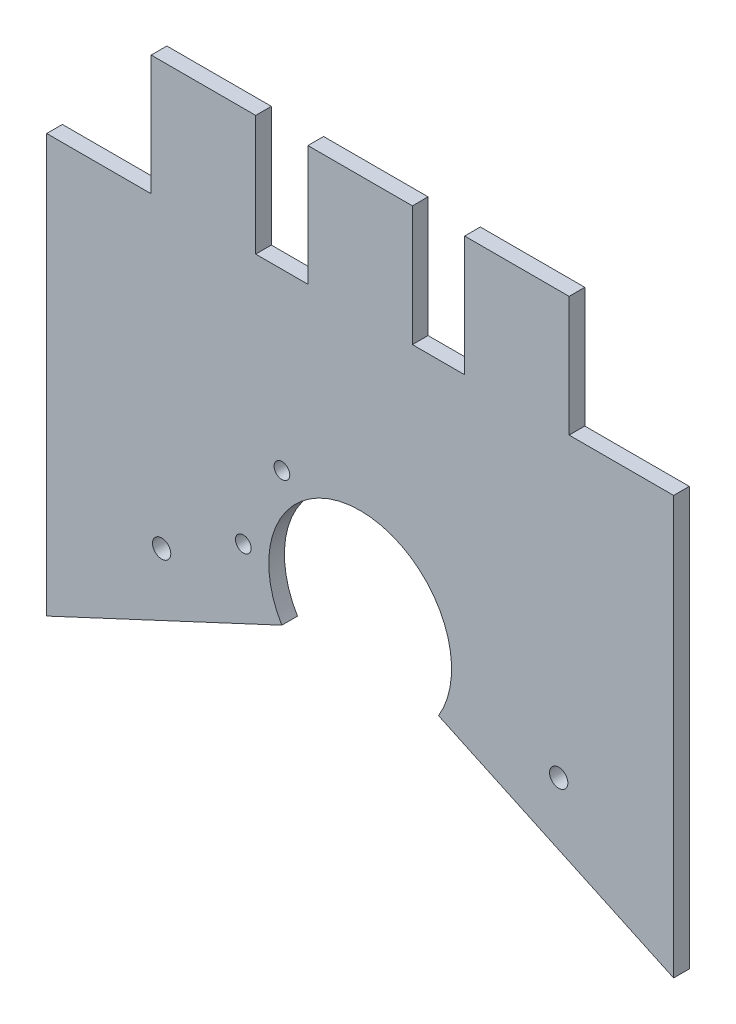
ISO-10303-21;
HEADER;
FILE_DESCRIPTION(('STEP AP214'),'2;1');
FILE_NAME('part.step','',(''),(''),'','','');
FILE_SCHEMA(('AUTOMOTIVE_DESIGN { 1 0 10303 214 1 1 1 1 }'));
ENDSEC;
DATA;
#1=APPLICATION_CONTEXT('core data for automotive mechanical design processes');
#2=APPLICATION_PROTOCOL_DEFINITION('international standard','automotive_design',2000,#1);
#3=PRODUCT_CONTEXT('',#1,'mechanical');
#4=PRODUCT('Part','Part','',(#3));
#5=PRODUCT_RELATED_PRODUCT_CATEGORY('part','',(#4));
#6=PRODUCT_DEFINITION_FORMATION('','',#4);
#7=PRODUCT_DEFINITION_CONTEXT('part definition',#1,'design');
#8=PRODUCT_DEFINITION('design','',#6,#7);
#9=PRODUCT_DEFINITION_SHAPE('','',#8);
#10=(LENGTH_UNIT() NAMED_UNIT(*) SI_UNIT(.MILLI.,.METRE.));
#11=(NAMED_UNIT(*) PLANE_ANGLE_UNIT() SI_UNIT($,.RADIAN.));
#12=(NAMED_UNIT(*) SI_UNIT($,.STERADIAN.) SOLID_ANGLE_UNIT());
#13=UNCERTAINTY_MEASURE_WITH_UNIT(LENGTH_MEASURE(1.E-05),#10,'distance_accuracy_value','');
#14=(GEOMETRIC_REPRESENTATION_CONTEXT(3) GLOBAL_UNCERTAINTY_ASSIGNED_CONTEXT((#13)) GLOBAL_UNIT_ASSIGNED_CONTEXT((#10,
#11,#12)) REPRESENTATION_CONTEXT('',''));
#15=CARTESIAN_POINT('',(0.,0.,0.));
#16=DIRECTION('',(0.,0.,1.));
#17=DIRECTION('',(1.,0.,0.));
#18=AXIS2_PLACEMENT_3D('',#15,#16,#17);
#19=CARTESIAN_POINT('',(0.,-73.,3.));
#20=DIRECTION('',(0.,0.,-1.));
#21=DIRECTION('',(-1.,0.,0.));
#22=AXIS2_PLACEMENT_3D('',#19,#20,#21);
#23=CYLINDRICAL_SURFACE('',#22,17.5);
#24=CARTESIAN_POINT('',(0.,-73.,0.));
#25=DIRECTION('',(0.,0.,1.));
#26=DIRECTION('',(1.,0.,0.));
#27=AXIS2_PLACEMENT_3D('',#24,#25,#26);
#28=CIRCLE('',#27,17.5);
#29=CARTESIAN_POINT('',(14.9989309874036,-82.0156568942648,0.));
#30=VERTEX_POINT('',#29);
#31=CARTESIAN_POINT('',(-14.9989309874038,-82.0156568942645,0.));
#32=VERTEX_POINT('',#31);
#33=EDGE_CURVE('E201',#30,#32,#28,.T.);
#34=ORIENTED_EDGE('',*,*,#33,.F.);
#35=DIRECTION('',(0.,0.,-1.));
#36=VECTOR('',#35,1.);
#37=CARTESIAN_POINT('',(14.9989309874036,-82.0156568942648,3.));
#38=LINE('',#37,#36);
#39=CARTESIAN_POINT('',(14.9989309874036,-82.0156568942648,3.));
#40=VERTEX_POINT('',#39);
#41=EDGE_CURVE('E11',#40,#30,#38,.T.);
#42=ORIENTED_EDGE('',*,*,#41,.F.);
#43=CARTESIAN_POINT('',(0.,-73.,3.));
#44=DIRECTION('',(0.,0.,1.));
#45=DIRECTION('',(1.,0.,0.));
#46=AXIS2_PLACEMENT_3D('',#43,#44,#45);
#47=CIRCLE('',#46,17.5);
#48=CARTESIAN_POINT('',(-14.9989309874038,-82.0156568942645,3.));
#49=VERTEX_POINT('',#48);
#50=EDGE_CURVE('E256',#40,#49,#47,.T.);
#51=ORIENTED_EDGE('',*,*,#50,.T.);
#52=DIRECTION('',(0.,0.,-1.));
#53=VECTOR('',#52,1.);
#54=CARTESIAN_POINT('',(-14.9989309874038,-82.0156568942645,3.));
#55=LINE('',#54,#53);
#56=EDGE_CURVE('E116',#49,#32,#55,.T.);
#57=ORIENTED_EDGE('',*,*,#56,.T.);
#58=EDGE_LOOP('',(#34,#42,#51,#57));
#59=FACE_BOUND('',#58,.T.);
#60=ADVANCED_FACE('F35',(#59),#23,.F.);
#61=CARTESIAN_POINT('',(-28.7349171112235,-61.6222286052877,3.));
#62=DIRECTION('',(0.422618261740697,0.906307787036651,0.));
#63=DIRECTION('',(-0.906307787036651,0.422618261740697,0.));
#64=AXIS2_PLACEMENT_3D('',#61,#62,#63);
#65=PLANE('',#64);
#66=DIRECTION('',(0.906307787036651,-0.422618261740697,0.));
#67=VECTOR('',#66,1.);
#68=CARTESIAN_POINT('',(-28.7349171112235,-61.6222286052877,0.));
#69=LINE('',#68,#67);
#70=CARTESIAN_POINT('',(60.,-103.,0.));
#71=VERTEX_POINT('',#70);
#72=EDGE_CURVE('E204',#30,#71,#69,.T.);
#73=ORIENTED_EDGE('',*,*,#72,.T.);
#74=DIRECTION('',(0.,0.,-1.));
#75=VECTOR('',#74,1.);
#76=CARTESIAN_POINT('',(60.,-103.,3.));
#77=LINE('',#76,#75);
#78=CARTESIAN_POINT('',(60.,-103.,3.));
#79=VERTEX_POINT('',#78);
#80=EDGE_CURVE('E43',#79,#71,#77,.T.);
#81=ORIENTED_EDGE('',*,*,#80,.F.);
#82=DIRECTION('',(0.906307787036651,-0.422618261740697,0.));
#83=VECTOR('',#82,1.);
#84=CARTESIAN_POINT('',(-28.7349171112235,-61.6222286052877,3.));
#85=LINE('',#84,#83);
#86=EDGE_CURVE('E313',#40,#79,#85,.T.);
#87=ORIENTED_EDGE('',*,*,#86,.F.);
#88=ORIENTED_EDGE('',*,*,#41,.T.);
#89=EDGE_LOOP('',(#73,#81,#87,#88));
#90=FACE_BOUND('',#89,.T.);
#91=ADVANCED_FACE('F352',(#90),#65,.F.);
#92=CARTESIAN_POINT('',(59.9999999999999,0.,3.));
#93=DIRECTION('',(-1.,0.,0.));
#94=DIRECTION('',(0.,-1.,0.));
#95=AXIS2_PLACEMENT_3D('',#92,#93,#94);
#96=PLANE('',#95);
#97=DIRECTION('',(0.,1.,0.));
#98=VECTOR('',#97,1.);
#99=CARTESIAN_POINT('',(59.9999999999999,0.,0.));
#100=LINE('',#99,#98);
#101=CARTESIAN_POINT('',(60.,-23.,0.));
#102=VERTEX_POINT('',#101);
#103=EDGE_CURVE('E206',#71,#102,#100,.T.);
#104=ORIENTED_EDGE('',*,*,#103,.T.);
#105=DIRECTION('',(0.,0.,-1.));
#106=VECTOR('',#105,1.);
#107=CARTESIAN_POINT('',(60.,-23.,3.));
#108=LINE('',#107,#106);
#109=CARTESIAN_POINT('',(60.,-23.,3.));
#110=VERTEX_POINT('',#109);
#111=EDGE_CURVE('E286',#110,#102,#108,.T.);
#112=ORIENTED_EDGE('',*,*,#111,.F.);
#113=DIRECTION('',(0.,1.,0.));
#114=VECTOR('',#113,1.);
#115=CARTESIAN_POINT('',(59.9999999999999,0.,3.));
#116=LINE('',#115,#114);
#117=EDGE_CURVE('E294',#79,#110,#116,.T.);
#118=ORIENTED_EDGE('',*,*,#117,.F.);
#119=ORIENTED_EDGE('',*,*,#80,.T.);
#120=EDGE_LOOP('',(#104,#112,#118,#119));
#121=FACE_BOUND('',#120,.T.);
#122=ADVANCED_FACE('F292',(#121),#96,.F.);
#123=CARTESIAN_POINT('',(0.,-23.,3.));
#124=DIRECTION('',(0.,1.,0.));
#125=DIRECTION('',(0.,0.,1.));
#126=AXIS2_PLACEMENT_3D('',#123,#124,#125);
#127=PLANE('',#126);
#128=DIRECTION('',(1.,0.,0.));
#129=VECTOR('',#128,1.);
#130=CARTESIAN_POINT('',(0.,-23.,0.));
#131=LINE('',#130,#129);
#132=CARTESIAN_POINT('',(40.,-23.,0.));
#133=VERTEX_POINT('',#132);
#134=EDGE_CURVE('E209',#133,#102,#131,.T.);
#135=ORIENTED_EDGE('',*,*,#134,.F.);
#136=DIRECTION('',(0.,0.,-1.));
#137=VECTOR('',#136,1.);
#138=CARTESIAN_POINT('',(40.,-23.,3.));
#139=LINE('',#138,#137);
#140=CARTESIAN_POINT('',(40.,-23.,3.));
#141=VERTEX_POINT('',#140);
#142=EDGE_CURVE('E284',#141,#133,#139,.T.);
#143=ORIENTED_EDGE('',*,*,#142,.F.);
#144=DIRECTION('',(1.,0.,0.));
#145=VECTOR('',#144,1.);
#146=CARTESIAN_POINT('',(0.,-23.,3.));
#147=LINE('',#146,#145);
#148=EDGE_CURVE('E306',#141,#110,#147,.T.);
#149=ORIENTED_EDGE('',*,*,#148,.T.);
#150=ORIENTED_EDGE('',*,*,#111,.T.);
#151=EDGE_LOOP('',(#135,#143,#149,#150));
#152=FACE_BOUND('',#151,.T.);
#153=ADVANCED_FACE('F303',(#152),#127,.T.);
#154=CARTESIAN_POINT('',(40.,0.,3.));
#155=DIRECTION('',(1.,0.,0.));
#156=DIRECTION('',(0.,0.,-1.));
#157=AXIS2_PLACEMENT_3D('',#154,#155,#156);
#158=PLANE('',#157);
#159=DIRECTION('',(0.,-1.,0.));
#160=VECTOR('',#159,1.);
#161=CARTESIAN_POINT('',(40.,0.,0.));
#162=LINE('',#161,#160);
#163=CARTESIAN_POINT('',(40.,0.,0.));
#164=VERTEX_POINT('',#163);
#165=EDGE_CURVE('E212',#164,#133,#162,.T.);
#166=ORIENTED_EDGE('',*,*,#165,.F.);
#167=DIRECTION('',(0.,0.,-1.));
#168=VECTOR('',#167,1.);
#169=CARTESIAN_POINT('',(40.,0.,3.));
#170=LINE('',#169,#168);
#171=CARTESIAN_POINT('',(40.,0.,3.));
#172=VERTEX_POINT('',#171);
#173=EDGE_CURVE('E282',#172,#164,#170,.T.);
#174=ORIENTED_EDGE('',*,*,#173,.F.);
#175=DIRECTION('',(0.,-1.,0.));
#176=VECTOR('',#175,1.);
#177=CARTESIAN_POINT('',(40.,0.,3.));
#178=LINE('',#177,#176);
#179=EDGE_CURVE('E309',#172,#141,#178,.T.);
#180=ORIENTED_EDGE('',*,*,#179,.T.);
#181=ORIENTED_EDGE('',*,*,#142,.T.);
#182=EDGE_LOOP('',(#166,#174,#180,#181));
#183=FACE_BOUND('',#182,.T.);
#184=ADVANCED_FACE('F362',(#183),#158,.T.);
#185=CARTESIAN_POINT('',(0.,0.,3.));
#186=DIRECTION('',(0.,1.,0.));
#187=DIRECTION('',(0.,0.,1.));
#188=AXIS2_PLACEMENT_3D('',#185,#186,#187);
#189=PLANE('',#188);
#190=DIRECTION('',(1.,0.,0.));
#191=VECTOR('',#190,1.);
#192=CARTESIAN_POINT('',(0.,0.,0.));
#193=LINE('',#192,#191);
#194=CARTESIAN_POINT('',(20.,0.,0.));
#195=VERTEX_POINT('',#194);
#196=EDGE_CURVE('E215',#195,#164,#193,.T.);
#197=ORIENTED_EDGE('',*,*,#196,.F.);
#198=DIRECTION('',(0.,0.,-1.));
#199=VECTOR('',#198,1.);
#200=CARTESIAN_POINT('',(20.,0.,3.));
#201=LINE('',#200,#199);
#202=CARTESIAN_POINT('',(20.,0.,3.));
#203=VERTEX_POINT('',#202);
#204=EDGE_CURVE('E280',#203,#195,#201,.T.);
#205=ORIENTED_EDGE('',*,*,#204,.F.);
#206=DIRECTION('',(1.,0.,0.));
#207=VECTOR('',#206,1.);
#208=CARTESIAN_POINT('',(0.,0.,3.));
#209=LINE('',#208,#207);
#210=EDGE_CURVE('E311',#203,#172,#209,.T.);
#211=ORIENTED_EDGE('',*,*,#210,.T.);
#212=ORIENTED_EDGE('',*,*,#173,.T.);
#213=EDGE_LOOP('',(#197,#205,#211,#212));
#214=FACE_BOUND('',#213,.T.);
#215=ADVANCED_FACE('F365',(#214),#189,.T.);
#216=CARTESIAN_POINT('',(20.,0.,3.));
#217=DIRECTION('',(-1.,0.,0.));
#218=DIRECTION('',(0.,0.,1.));
#219=AXIS2_PLACEMENT_3D('',#216,#217,#218);
#220=PLANE('',#219);
#221=DIRECTION('',(0.,1.,0.));
#222=VECTOR('',#221,1.);
#223=CARTESIAN_POINT('',(20.,0.,0.));
#224=LINE('',#223,#222);
#225=CARTESIAN_POINT('',(20.,-23.,0.));
#226=VERTEX_POINT('',#225);
#227=EDGE_CURVE('E218',#226,#195,#224,.T.);
#228=ORIENTED_EDGE('',*,*,#227,.F.);
#229=DIRECTION('',(0.,0.,-1.));
#230=VECTOR('',#229,1.);
#231=CARTESIAN_POINT('',(20.,-23.,3.));
#232=LINE('',#231,#230);
#233=CARTESIAN_POINT('',(20.,-23.,3.));
#234=VERTEX_POINT('',#233);
#235=EDGE_CURVE('E278',#234,#226,#232,.T.);
#236=ORIENTED_EDGE('',*,*,#235,.F.);
#237=DIRECTION('',(0.,1.,0.));
#238=VECTOR('',#237,1.);
#239=CARTESIAN_POINT('',(20.,0.,3.));
#240=LINE('',#239,#238);
#241=EDGE_CURVE('E319',#234,#203,#240,.T.);
#242=ORIENTED_EDGE('',*,*,#241,.T.);
#243=ORIENTED_EDGE('',*,*,#204,.T.);
#244=EDGE_LOOP('',(#228,#236,#242,#243));
#245=FACE_BOUND('',#244,.T.);
#246=ADVANCED_FACE('F369',(#245),#220,.T.);
#247=CARTESIAN_POINT('',(0.,-23.,3.));
#248=DIRECTION('',(0.,1.,0.));
#249=DIRECTION('',(0.,0.,1.));
#250=AXIS2_PLACEMENT_3D('',#247,#248,#249);
#251=PLANE('',#250);
#252=DIRECTION('',(1.,0.,0.));
#253=VECTOR('',#252,1.);
#254=CARTESIAN_POINT('',(0.,-23.,0.));
#255=LINE('',#254,#253);
#256=CARTESIAN_POINT('',(10.,-23.,0.));
#257=VERTEX_POINT('',#256);
#258=EDGE_CURVE('E221',#257,#226,#255,.T.);
#259=ORIENTED_EDGE('',*,*,#258,.F.);
#260=DIRECTION('',(0.,0.,-1.));
#261=VECTOR('',#260,1.);
#262=CARTESIAN_POINT('',(10.,-23.,3.));
#263=LINE('',#262,#261);
#264=CARTESIAN_POINT('',(10.,-23.,3.));
#265=VERTEX_POINT('',#264);
#266=EDGE_CURVE('E276',#265,#257,#263,.T.);
#267=ORIENTED_EDGE('',*,*,#266,.F.);
#268=DIRECTION('',(1.,0.,0.));
#269=VECTOR('',#268,1.);
#270=CARTESIAN_POINT('',(0.,-23.,3.));
#271=LINE('',#270,#269);
#272=EDGE_CURVE('E322',#265,#234,#271,.T.);
#273=ORIENTED_EDGE('',*,*,#272,.T.);
#274=ORIENTED_EDGE('',*,*,#235,.T.);
#275=EDGE_LOOP('',(#259,#267,#273,#274));
#276=FACE_BOUND('',#275,.T.);
#277=ADVANCED_FACE('F373',(#276),#251,.T.);
#278=CARTESIAN_POINT('',(10.,0.,3.));
#279=DIRECTION('',(1.,0.,0.));
#280=DIRECTION('',(0.,0.,-1.));
#281=AXIS2_PLACEMENT_3D('',#278,#279,#280);
#282=PLANE('',#281);
#283=DIRECTION('',(0.,-1.,0.));
#284=VECTOR('',#283,1.);
#285=CARTESIAN_POINT('',(10.,0.,0.));
#286=LINE('',#285,#284);
#287=CARTESIAN_POINT('',(10.,0.,0.));
#288=VERTEX_POINT('',#287);
#289=EDGE_CURVE('E224',#288,#257,#286,.T.);
#290=ORIENTED_EDGE('',*,*,#289,.F.);
#291=DIRECTION('',(0.,0.,-1.));
#292=VECTOR('',#291,1.);
#293=CARTESIAN_POINT('',(10.,0.,3.));
#294=LINE('',#293,#292);
#295=CARTESIAN_POINT('',(10.,0.,3.));
#296=VERTEX_POINT('',#295);
#297=EDGE_CURVE('E274',#296,#288,#294,.T.);
#298=ORIENTED_EDGE('',*,*,#297,.F.);
#299=DIRECTION('',(0.,-1.,0.));
#300=VECTOR('',#299,1.);
#301=CARTESIAN_POINT('',(10.,0.,3.));
#302=LINE('',#301,#300);
#303=EDGE_CURVE('E325',#296,#265,#302,.T.);
#304=ORIENTED_EDGE('',*,*,#303,.T.);
#305=ORIENTED_EDGE('',*,*,#266,.T.);
#306=EDGE_LOOP('',(#290,#298,#304,#305));
#307=FACE_BOUND('',#306,.T.);
#308=ADVANCED_FACE('F377',(#307),#282,.T.);
#309=CARTESIAN_POINT('',(0.,0.,3.));
#310=DIRECTION('',(0.,1.,0.));
#311=DIRECTION('',(0.,0.,1.));
#312=AXIS2_PLACEMENT_3D('',#309,#310,#311);
#313=PLANE('',#312);
#314=DIRECTION('',(1.,0.,0.));
#315=VECTOR('',#314,1.);
#316=CARTESIAN_POINT('',(0.,0.,0.));
#317=LINE('',#316,#315);
#318=CARTESIAN_POINT('',(-10.,0.,0.));
#319=VERTEX_POINT('',#318);
#320=EDGE_CURVE('E227',#319,#288,#317,.T.);
#321=ORIENTED_EDGE('',*,*,#320,.F.);
#322=DIRECTION('',(0.,0.,-1.));
#323=VECTOR('',#322,1.);
#324=CARTESIAN_POINT('',(-10.,0.,3.));
#325=LINE('',#324,#323);
#326=CARTESIAN_POINT('',(-10.,0.,3.));
#327=VERTEX_POINT('',#326);
#328=EDGE_CURVE('E272',#327,#319,#325,.T.);
#329=ORIENTED_EDGE('',*,*,#328,.F.);
#330=DIRECTION('',(1.,0.,0.));
#331=VECTOR('',#330,1.);
#332=CARTESIAN_POINT('',(0.,0.,3.));
#333=LINE('',#332,#331);
#334=EDGE_CURVE('E328',#327,#296,#333,.T.);
#335=ORIENTED_EDGE('',*,*,#334,.T.);
#336=ORIENTED_EDGE('',*,*,#297,.T.);
#337=EDGE_LOOP('',(#321,#329,#335,#336));
#338=FACE_BOUND('',#337,.T.);
#339=ADVANCED_FACE('F381',(#338),#313,.T.);
#340=CARTESIAN_POINT('',(-10.,0.,3.));
#341=DIRECTION('',(1.,0.,0.));
#342=DIRECTION('',(0.,0.,-1.));
#343=AXIS2_PLACEMENT_3D('',#340,#341,#342);
#344=PLANE('',#343);
#345=DIRECTION('',(0.,-1.,0.));
#346=VECTOR('',#345,1.);
#347=CARTESIAN_POINT('',(-10.,0.,0.));
#348=LINE('',#347,#346);
#349=CARTESIAN_POINT('',(-10.,-23.,0.));
#350=VERTEX_POINT('',#349);
#351=EDGE_CURVE('E230',#319,#350,#348,.T.);
#352=ORIENTED_EDGE('',*,*,#351,.T.);
#353=DIRECTION('',(0.,0.,-1.));
#354=VECTOR('',#353,1.);
#355=CARTESIAN_POINT('',(-10.,-23.,3.));
#356=LINE('',#355,#354);
#357=CARTESIAN_POINT('',(-10.,-23.,3.));
#358=VERTEX_POINT('',#357);
#359=EDGE_CURVE('E269',#358,#350,#356,.T.);
#360=ORIENTED_EDGE('',*,*,#359,.F.);
#361=DIRECTION('',(0.,-1.,0.));
#362=VECTOR('',#361,1.);
#363=CARTESIAN_POINT('',(-10.,0.,3.));
#364=LINE('',#363,#362);
#365=EDGE_CURVE('E331',#327,#358,#364,.T.);
#366=ORIENTED_EDGE('',*,*,#365,.F.);
#367=ORIENTED_EDGE('',*,*,#328,.T.);
#368=EDGE_LOOP('',(#352,#360,#366,#367));
#369=FACE_BOUND('',#368,.T.);
#370=ADVANCED_FACE('F385',(#369),#344,.F.);
#371=CARTESIAN_POINT('',(0.,-23.,3.));
#372=DIRECTION('',(0.,-1.,0.));
#373=DIRECTION('',(0.,0.,-1.));
#374=AXIS2_PLACEMENT_3D('',#371,#372,#373);
#375=PLANE('',#374);
#376=DIRECTION('',(-1.,0.,0.));
#377=VECTOR('',#376,1.);
#378=CARTESIAN_POINT('',(0.,-23.,0.));
#379=LINE('',#378,#377);
#380=CARTESIAN_POINT('',(-20.,-23.,0.));
#381=VERTEX_POINT('',#380);
#382=EDGE_CURVE('E232',#350,#381,#379,.T.);
#383=ORIENTED_EDGE('',*,*,#382,.T.);
#384=DIRECTION('',(0.,0.,-1.));
#385=VECTOR('',#384,1.);
#386=CARTESIAN_POINT('',(-20.,-23.,3.));
#387=LINE('',#386,#385);
#388=CARTESIAN_POINT('',(-20.,-23.,3.));
#389=VERTEX_POINT('',#388);
#390=EDGE_CURVE('E266',#389,#381,#387,.T.);
#391=ORIENTED_EDGE('',*,*,#390,.F.);
#392=DIRECTION('',(-1.,0.,0.));
#393=VECTOR('',#392,1.);
#394=CARTESIAN_POINT('',(0.,-23.,3.));
#395=LINE('',#394,#393);
#396=EDGE_CURVE('E333',#358,#389,#395,.T.);
#397=ORIENTED_EDGE('',*,*,#396,.F.);
#398=ORIENTED_EDGE('',*,*,#359,.T.);
#399=EDGE_LOOP('',(#383,#391,#397,#398));
#400=FACE_BOUND('',#399,.T.);
#401=ADVANCED_FACE('F389',(#400),#375,.F.);
#402=CARTESIAN_POINT('',(-20.,0.,3.));
#403=DIRECTION('',(-1.,0.,0.));
#404=DIRECTION('',(0.,0.,1.));
#405=AXIS2_PLACEMENT_3D('',#402,#403,#404);
#406=PLANE('',#405);
#407=DIRECTION('',(0.,1.,0.));
#408=VECTOR('',#407,1.);
#409=CARTESIAN_POINT('',(-20.,0.,0.));
#410=LINE('',#409,#408);
#411=CARTESIAN_POINT('',(-20.,0.,0.));
#412=VERTEX_POINT('',#411);
#413=EDGE_CURVE('E234',#381,#412,#410,.T.);
#414=ORIENTED_EDGE('',*,*,#413,.T.);
#415=DIRECTION('',(0.,0.,-1.));
#416=VECTOR('',#415,1.);
#417=CARTESIAN_POINT('',(-20.,0.,3.));
#418=LINE('',#417,#416);
#419=CARTESIAN_POINT('',(-20.,0.,3.));
#420=VERTEX_POINT('',#419);
#421=EDGE_CURVE('E263',#420,#412,#418,.T.);
#422=ORIENTED_EDGE('',*,*,#421,.F.);
#423=DIRECTION('',(0.,1.,0.));
#424=VECTOR('',#423,1.);
#425=CARTESIAN_POINT('',(-20.,0.,3.));
#426=LINE('',#425,#424);
#427=EDGE_CURVE('E335',#389,#420,#426,.T.);
#428=ORIENTED_EDGE('',*,*,#427,.F.);
#429=ORIENTED_EDGE('',*,*,#390,.T.);
#430=EDGE_LOOP('',(#414,#422,#428,#429));
#431=FACE_BOUND('',#430,.T.);
#432=ADVANCED_FACE('F393',(#431),#406,.F.);
#433=CARTESIAN_POINT('',(0.,0.,3.));
#434=DIRECTION('',(0.,-1.,0.));
#435=DIRECTION('',(0.,0.,-1.));
#436=AXIS2_PLACEMENT_3D('',#433,#434,#435);
#437=PLANE('',#436);
#438=DIRECTION('',(-1.,0.,0.));
#439=VECTOR('',#438,1.);
#440=CARTESIAN_POINT('',(0.,0.,0.));
#441=LINE('',#440,#439);
#442=CARTESIAN_POINT('',(-40.,0.,0.));
#443=VERTEX_POINT('',#442);
#444=EDGE_CURVE('E236',#412,#443,#441,.T.);
#445=ORIENTED_EDGE('',*,*,#444,.T.);
#446=DIRECTION('',(0.,0.,-1.));
#447=VECTOR('',#446,1.);
#448=CARTESIAN_POINT('',(-40.,0.,3.));
#449=LINE('',#448,#447);
#450=CARTESIAN_POINT('',(-40.,0.,3.));
#451=VERTEX_POINT('',#450);
#452=EDGE_CURVE('E260',#451,#443,#449,.T.);
#453=ORIENTED_EDGE('',*,*,#452,.F.);
#454=DIRECTION('',(-1.,0.,0.));
#455=VECTOR('',#454,1.);
#456=CARTESIAN_POINT('',(0.,0.,3.));
#457=LINE('',#456,#455);
#458=EDGE_CURVE('E337',#420,#451,#457,.T.);
#459=ORIENTED_EDGE('',*,*,#458,.F.);
#460=ORIENTED_EDGE('',*,*,#421,.T.);
#461=EDGE_LOOP('',(#445,#453,#459,#460));
#462=FACE_BOUND('',#461,.T.);
#463=ADVANCED_FACE('F343',(#462),#437,.F.);
#464=CARTESIAN_POINT('',(-40.,0.,3.));
#465=DIRECTION('',(1.,0.,0.));
#466=DIRECTION('',(0.,0.,-1.));
#467=AXIS2_PLACEMENT_3D('',#464,#465,#466);
#468=PLANE('',#467);
#469=DIRECTION('',(0.,-1.,0.));
#470=VECTOR('',#469,1.);
#471=CARTESIAN_POINT('',(-40.,0.,0.));
#472=LINE('',#471,#470);
#473=CARTESIAN_POINT('',(-40.,-23.,0.));
#474=VERTEX_POINT('',#473);
#475=EDGE_CURVE('E238',#443,#474,#472,.T.);
#476=ORIENTED_EDGE('',*,*,#475,.T.);
#477=DIRECTION('',(0.,0.,-1.));
#478=VECTOR('',#477,1.);
#479=CARTESIAN_POINT('',(-40.,-23.,3.));
#480=LINE('',#479,#478);
#481=CARTESIAN_POINT('',(-40.,-23.,3.));
#482=VERTEX_POINT('',#481);
#483=EDGE_CURVE('E181',#482,#474,#480,.T.);
#484=ORIENTED_EDGE('',*,*,#483,.F.);
#485=DIRECTION('',(0.,-1.,0.));
#486=VECTOR('',#485,1.);
#487=CARTESIAN_POINT('',(-40.,0.,3.));
#488=LINE('',#487,#486);
#489=EDGE_CURVE('E172',#451,#482,#488,.T.);
#490=ORIENTED_EDGE('',*,*,#489,.F.);
#491=ORIENTED_EDGE('',*,*,#452,.T.);
#492=EDGE_LOOP('',(#476,#484,#490,#491));
#493=FACE_BOUND('',#492,.T.);
#494=ADVANCED_FACE('F347',(#493),#468,.F.);
#495=CARTESIAN_POINT('',(0.,-23.,3.));
#496=DIRECTION('',(0.,-1.,0.));
#497=DIRECTION('',(0.,0.,-1.));
#498=AXIS2_PLACEMENT_3D('',#495,#496,#497);
#499=PLANE('',#498);
#500=DIRECTION('',(-1.,0.,0.));
#501=VECTOR('',#500,1.);
#502=CARTESIAN_POINT('',(0.,-23.,0.));
#503=LINE('',#502,#501);
#504=CARTESIAN_POINT('',(-60.,-23.,0.));
#505=VERTEX_POINT('',#504);
#506=EDGE_CURVE('E180',#474,#505,#503,.T.);
#507=ORIENTED_EDGE('',*,*,#506,.T.);
#508=DIRECTION('',(0.,0.,-1.));
#509=VECTOR('',#508,1.);
#510=CARTESIAN_POINT('',(-60.,-23.,3.));
#511=LINE('',#510,#509);
#512=CARTESIAN_POINT('',(-60.,-23.,3.));
#513=VERTEX_POINT('',#512);
#514=EDGE_CURVE('E177',#513,#505,#511,.T.);
#515=ORIENTED_EDGE('',*,*,#514,.F.);
#516=DIRECTION('',(-1.,0.,0.));
#517=VECTOR('',#516,1.);
#518=CARTESIAN_POINT('',(0.,-23.,3.));
#519=LINE('',#518,#517);
#520=EDGE_CURVE('E165',#482,#513,#519,.T.);
#521=ORIENTED_EDGE('',*,*,#520,.F.);
#522=ORIENTED_EDGE('',*,*,#483,.T.);
#523=EDGE_LOOP('',(#507,#515,#521,#522));
#524=FACE_BOUND('',#523,.T.);
#525=ADVANCED_FACE('F178',(#524),#499,.F.);
#526=CARTESIAN_POINT('',(-60.,0.,3.));
#527=DIRECTION('',(1.,0.,0.));
#528=DIRECTION('',(0.,1.,0.));
#529=AXIS2_PLACEMENT_3D('',#526,#527,#528);
#530=PLANE('',#529);
#531=DIRECTION('',(0.,-1.,0.));
#532=VECTOR('',#531,1.);
#533=CARTESIAN_POINT('',(-60.,0.,0.));
#534=LINE('',#533,#532);
#535=CARTESIAN_POINT('',(-60.,-103.,0.));
#536=VERTEX_POINT('',#535);
#537=EDGE_CURVE('E109',#505,#536,#534,.T.);
#538=ORIENTED_EDGE('',*,*,#537,.T.);
#539=DIRECTION('',(0.,0.,-1.));
#540=VECTOR('',#539,1.);
#541=CARTESIAN_POINT('',(-60.,-103.,3.));
#542=LINE('',#541,#540);
#543=CARTESIAN_POINT('',(-60.,-103.,3.));
#544=VERTEX_POINT('',#543);
#545=EDGE_CURVE('E182',#544,#536,#542,.T.);
#546=ORIENTED_EDGE('',*,*,#545,.F.);
#547=DIRECTION('',(0.,-1.,0.));
#548=VECTOR('',#547,1.);
#549=CARTESIAN_POINT('',(-60.,0.,3.));
#550=LINE('',#549,#548);
#551=EDGE_CURVE('E170',#513,#544,#550,.T.);
#552=ORIENTED_EDGE('',*,*,#551,.F.);
#553=ORIENTED_EDGE('',*,*,#514,.T.);
#554=EDGE_LOOP('',(#538,#546,#552,#553));
#555=FACE_BOUND('',#554,.T.);
#556=ADVANCED_FACE('F184',(#555),#530,.F.);
#557=CARTESIAN_POINT('',(-14.9720306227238,-56.3638706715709,3.));
#558=DIRECTION('',(0.,0.,-1.));
#559=DIRECTION('',(-1.,0.,0.));
#560=AXIS2_PLACEMENT_3D('',#557,#558,#559);
#561=CYLINDRICAL_SURFACE('',#560,1.5);
#562=CARTESIAN_POINT('',(-14.9720306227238,-56.3638706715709,3.));
#563=DIRECTION('',(0.,0.,1.));
#564=DIRECTION('',(1.,0.,0.));
#565=AXIS2_PLACEMENT_3D('',#562,#563,#564);
#566=CIRCLE('',#565,1.5);
#567=CARTESIAN_POINT('',(-13.4720306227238,-56.3638706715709,3.));
#568=VERTEX_POINT('',#567);
#569=EDGE_CURVE('E195',#568,#568,#566,.T.);
#570=ORIENTED_EDGE('',*,*,#569,.T.);
#571=EDGE_LOOP('',(#570));
#572=FACE_BOUND('',#571,.T.);
#573=CARTESIAN_POINT('',(-14.9720306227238,-56.3638706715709,0.));
#574=DIRECTION('',(0.,0.,1.));
#575=DIRECTION('',(1.,0.,0.));
#576=AXIS2_PLACEMENT_3D('',#573,#574,#575);
#577=CIRCLE('',#576,1.5);
#578=CARTESIAN_POINT('',(-13.4720306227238,-56.3638706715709,0.));
#579=VERTEX_POINT('',#578);
#580=EDGE_CURVE('E250',#579,#579,#577,.T.);
#581=ORIENTED_EDGE('',*,*,#580,.F.);
#582=EDGE_LOOP('',(#581));
#583=FACE_BOUND('',#582,.T.);
#584=ADVANCED_FACE('F406',(#572,#583),#561,.F.);
#585=CARTESIAN_POINT('',(-22.3678502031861,-72.2242569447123,3.));
#586=DIRECTION('',(0.,0.,-1.));
#587=DIRECTION('',(-1.,0.,0.));
#588=AXIS2_PLACEMENT_3D('',#585,#586,#587);
#589=CYLINDRICAL_SURFACE('',#588,1.5);
#590=CARTESIAN_POINT('',(-22.3678502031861,-72.2242569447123,3.));
#591=DIRECTION('',(0.,0.,1.));
#592=DIRECTION('',(1.,0.,0.));
#593=AXIS2_PLACEMENT_3D('',#590,#591,#592);
#594=CIRCLE('',#593,1.5);
#595=CARTESIAN_POINT('',(-20.8678502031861,-72.2242569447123,3.));
#596=VERTEX_POINT('',#595);
#597=EDGE_CURVE('E192',#596,#596,#594,.T.);
#598=ORIENTED_EDGE('',*,*,#597,.T.);
#599=EDGE_LOOP('',(#598));
#600=FACE_BOUND('',#599,.T.);
#601=CARTESIAN_POINT('',(-22.3678502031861,-72.2242569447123,0.));
#602=DIRECTION('',(0.,0.,1.));
#603=DIRECTION('',(1.,0.,0.));
#604=AXIS2_PLACEMENT_3D('',#601,#602,#603);
#605=CIRCLE('',#604,1.5);
#606=CARTESIAN_POINT('',(-20.8678502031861,-72.2242569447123,0.));
#607=VERTEX_POINT('',#606);
#608=EDGE_CURVE('E247',#607,#607,#605,.T.);
#609=ORIENTED_EDGE('',*,*,#608,.F.);
#610=EDGE_LOOP('',(#609));
#611=FACE_BOUND('',#610,.T.);
#612=ADVANCED_FACE('F413',(#600,#611),#589,.F.);
#613=CARTESIAN_POINT('',(-38.,-80.8,3.));
#614=DIRECTION('',(0.,0.,-1.));
#615=DIRECTION('',(-1.,0.,0.));
#616=AXIS2_PLACEMENT_3D('',#613,#614,#615);
#617=CYLINDRICAL_SURFACE('',#616,1.75);
#618=CARTESIAN_POINT('',(-38.,-80.8,3.));
#619=DIRECTION('',(0.,0.,1.));
#620=DIRECTION('',(1.,0.,0.));
#621=AXIS2_PLACEMENT_3D('',#618,#619,#620);
#622=CIRCLE('',#621,1.75);
#623=CARTESIAN_POINT('',(-36.25,-80.8,3.));
#624=VERTEX_POINT('',#623);
#625=EDGE_CURVE('E186',#624,#624,#622,.F.);
#626=ORIENTED_EDGE('',*,*,#625,.F.);
#627=EDGE_LOOP('',(#626));
#628=FACE_BOUND('',#627,.T.);
#629=CARTESIAN_POINT('',(-38.,-80.8,0.));
#630=DIRECTION('',(0.,0.,1.));
#631=DIRECTION('',(1.,0.,0.));
#632=AXIS2_PLACEMENT_3D('',#629,#630,#631);
#633=CIRCLE('',#632,1.75);
#634=CARTESIAN_POINT('',(-36.25,-80.8,0.));
#635=VERTEX_POINT('',#634);
#636=EDGE_CURVE('E244',#635,#635,#633,.F.);
#637=ORIENTED_EDGE('',*,*,#636,.T.);
#638=EDGE_LOOP('',(#637));
#639=FACE_BOUND('',#638,.T.);
#640=ADVANCED_FACE('F410',(#628,#639),#617,.F.);
#641=CARTESIAN_POINT('',(28.7349171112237,-61.6222286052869,3.));
#642=DIRECTION('',(-0.422618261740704,0.906307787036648,0.));
#643=DIRECTION('',(-0.906307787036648,-0.422618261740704,0.));
#644=AXIS2_PLACEMENT_3D('',#641,#642,#643);
#645=PLANE('',#644);
#646=DIRECTION('',(0.906307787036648,0.422618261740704,0.));
#647=VECTOR('',#646,1.);
#648=CARTESIAN_POINT('',(28.7349171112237,-61.6222286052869,0.));
#649=LINE('',#648,#647);
#650=EDGE_CURVE('E242',#536,#32,#649,.T.);
#651=ORIENTED_EDGE('',*,*,#650,.T.);
#652=ORIENTED_EDGE('',*,*,#56,.F.);
#653=DIRECTION('',(0.906307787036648,0.422618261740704,0.));
#654=VECTOR('',#653,1.);
#655=CARTESIAN_POINT('',(28.7349171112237,-61.6222286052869,3.));
#656=LINE('',#655,#654);
#657=EDGE_CURVE('E51',#544,#49,#656,.T.);
#658=ORIENTED_EDGE('',*,*,#657,.F.);
#659=ORIENTED_EDGE('',*,*,#545,.T.);
#660=EDGE_LOOP('',(#651,#652,#658,#659));
#661=FACE_BOUND('',#660,.T.);
#662=ADVANCED_FACE('F350',(#661),#645,.F.);
#663=CARTESIAN_POINT('',(38.,-80.8,3.));
#664=DIRECTION('',(0.,0.,-1.));
#665=DIRECTION('',(-1.,0.,0.));
#666=AXIS2_PLACEMENT_3D('',#663,#664,#665);
#667=CYLINDRICAL_SURFACE('',#666,1.75);
#668=CARTESIAN_POINT('',(38.,-80.8,3.));
#669=DIRECTION('',(0.,0.,1.));
#670=DIRECTION('',(1.,0.,0.));
#671=AXIS2_PLACEMENT_3D('',#668,#669,#670);
#672=CIRCLE('',#671,1.75);
#673=CARTESIAN_POINT('',(39.75,-80.8,3.));
#674=VERTEX_POINT('',#673);
#675=EDGE_CURVE('E198',#674,#674,#672,.T.);
#676=ORIENTED_EDGE('',*,*,#675,.T.);
#677=EDGE_LOOP('',(#676));
#678=FACE_BOUND('',#677,.T.);
#679=CARTESIAN_POINT('',(38.,-80.8,0.));
#680=DIRECTION('',(0.,0.,1.));
#681=DIRECTION('',(1.,0.,0.));
#682=AXIS2_PLACEMENT_3D('',#679,#680,#681);
#683=CIRCLE('',#682,1.75);
#684=CARTESIAN_POINT('',(39.75,-80.8,0.));
#685=VERTEX_POINT('',#684);
#686=EDGE_CURVE('E253',#685,#685,#683,.T.);
#687=ORIENTED_EDGE('',*,*,#686,.F.);
#688=EDGE_LOOP('',(#687));
#689=FACE_BOUND('',#688,.T.);
#690=ADVANCED_FACE('F409',(#678,#689),#667,.F.);
#691=CARTESIAN_POINT('',(0.,0.,3.));
#692=DIRECTION('',(0.,0.,1.));
#693=DIRECTION('',(1.,0.,0.));
#694=AXIS2_PLACEMENT_3D('',#691,#692,#693);
#695=PLANE('',#694);
#696=ORIENTED_EDGE('',*,*,#50,.F.);
#697=ORIENTED_EDGE('',*,*,#86,.T.);
#698=ORIENTED_EDGE('',*,*,#117,.T.);
#699=ORIENTED_EDGE('',*,*,#148,.F.);
#700=ORIENTED_EDGE('',*,*,#179,.F.);
#701=ORIENTED_EDGE('',*,*,#210,.F.);
#702=ORIENTED_EDGE('',*,*,#241,.F.);
#703=ORIENTED_EDGE('',*,*,#272,.F.);
#704=ORIENTED_EDGE('',*,*,#303,.F.);
#705=ORIENTED_EDGE('',*,*,#334,.F.);
#706=ORIENTED_EDGE('',*,*,#365,.T.);
#707=ORIENTED_EDGE('',*,*,#396,.T.);
#708=ORIENTED_EDGE('',*,*,#427,.T.);
#709=ORIENTED_EDGE('',*,*,#458,.T.);
#710=ORIENTED_EDGE('',*,*,#489,.T.);
#711=ORIENTED_EDGE('',*,*,#520,.T.);
#712=ORIENTED_EDGE('',*,*,#551,.T.);
#713=ORIENTED_EDGE('',*,*,#657,.T.);
#714=EDGE_LOOP('',(#696,#697,#698,#699,#700,#701,#702,#703,#704,#705,#706,#707,#708,#709,#710,
#711,#712,#713));
#715=FACE_BOUND('',#714,.T.);
#716=ORIENTED_EDGE('',*,*,#625,.T.);
#717=EDGE_LOOP('',(#716));
#718=FACE_BOUND('',#717,.T.);
#719=ORIENTED_EDGE('',*,*,#597,.F.);
#720=EDGE_LOOP('',(#719));
#721=FACE_BOUND('',#720,.T.);
#722=ORIENTED_EDGE('',*,*,#569,.F.);
#723=EDGE_LOOP('',(#722));
#724=FACE_BOUND('',#723,.T.);
#725=ORIENTED_EDGE('',*,*,#675,.F.);
#726=EDGE_LOOP('',(#725));
#727=FACE_BOUND('',#726,.T.);
#728=ADVANCED_FACE('F167',(#715,#718,#721,#724,#727),#695,.T.);
#729=CARTESIAN_POINT('',(0.,0.,0.));
#730=DIRECTION('',(0.,0.,1.));
#731=DIRECTION('',(1.,0.,0.));
#732=AXIS2_PLACEMENT_3D('',#729,#730,#731);
#733=PLANE('',#732);
#734=ORIENTED_EDGE('',*,*,#33,.T.);
#735=ORIENTED_EDGE('',*,*,#650,.F.);
#736=ORIENTED_EDGE('',*,*,#537,.F.);
#737=ORIENTED_EDGE('',*,*,#506,.F.);
#738=ORIENTED_EDGE('',*,*,#475,.F.);
#739=ORIENTED_EDGE('',*,*,#444,.F.);
#740=ORIENTED_EDGE('',*,*,#413,.F.);
#741=ORIENTED_EDGE('',*,*,#382,.F.);
#742=ORIENTED_EDGE('',*,*,#351,.F.);
#743=ORIENTED_EDGE('',*,*,#320,.T.);
#744=ORIENTED_EDGE('',*,*,#289,.T.);
#745=ORIENTED_EDGE('',*,*,#258,.T.);
#746=ORIENTED_EDGE('',*,*,#227,.T.);
#747=ORIENTED_EDGE('',*,*,#196,.T.);
#748=ORIENTED_EDGE('',*,*,#165,.T.);
#749=ORIENTED_EDGE('',*,*,#134,.T.);
#750=ORIENTED_EDGE('',*,*,#103,.F.);
#751=ORIENTED_EDGE('',*,*,#72,.F.);
#752=EDGE_LOOP('',(#734,#735,#736,#737,#738,#739,#740,#741,#742,#743,#744,#745,#746,#747,#748,
#749,#750,#751));
#753=FACE_BOUND('',#752,.T.);
#754=ORIENTED_EDGE('',*,*,#636,.F.);
#755=EDGE_LOOP('',(#754));
#756=FACE_BOUND('',#755,.T.);
#757=ORIENTED_EDGE('',*,*,#608,.T.);
#758=EDGE_LOOP('',(#757));
#759=FACE_BOUND('',#758,.T.);
#760=ORIENTED_EDGE('',*,*,#580,.T.);
#761=EDGE_LOOP('',(#760));
#762=FACE_BOUND('',#761,.T.);
#763=ORIENTED_EDGE('',*,*,#686,.T.);
#764=EDGE_LOOP('',(#763));
#765=FACE_BOUND('',#764,.T.);
#766=ADVANCED_FACE('F298',(#753,#756,#759,#762,#765),#733,.F.);
#767=CLOSED_SHELL('',(#60,#91,#122,#153,#184,#215,#246,#277,#308,#339,#370,#401,#432,#463,#494,
#525,#556,#584,#612,#640,#662,#690,#728,#766));
#768=MANIFOLD_SOLID_BREP('B2',#767);
#769=ADVANCED_BREP_SHAPE_REPRESENTATION('',(#18,#768),#14);
#770=SHAPE_DEFINITION_REPRESENTATION(#9,#769);
ENDSEC;
END-ISO-10303-21;
